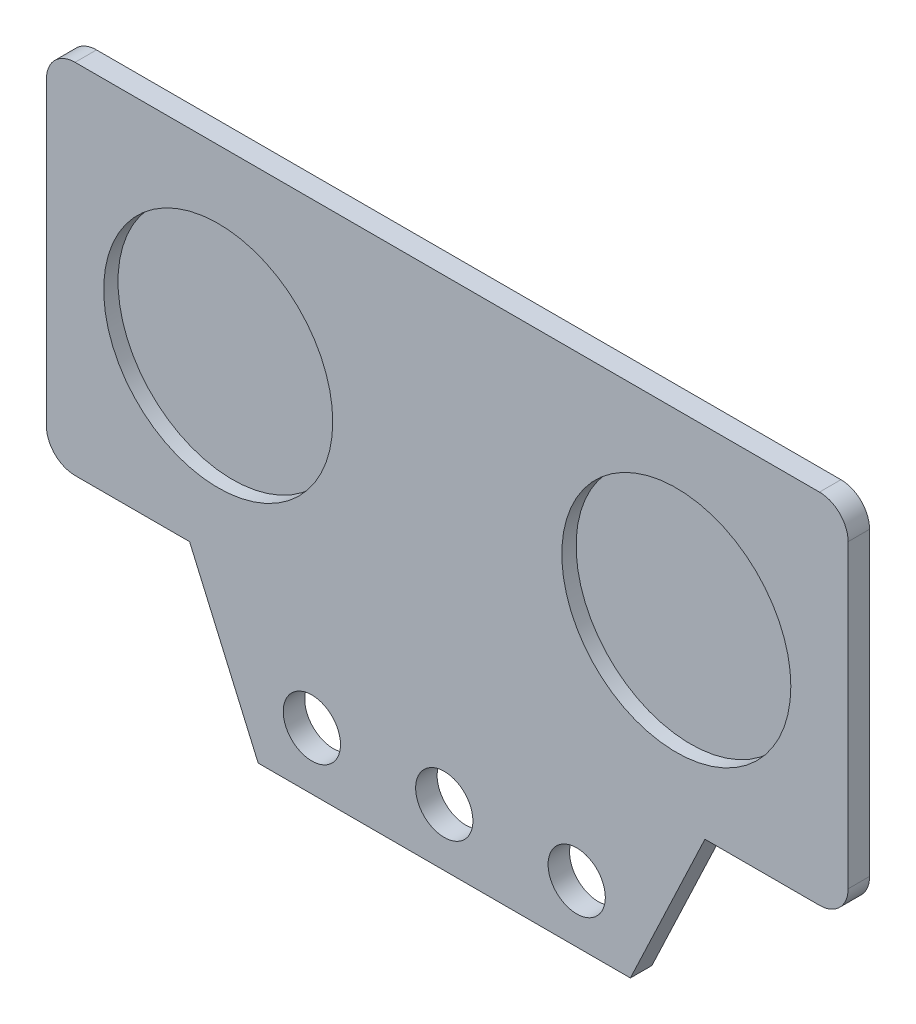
ISO-10303-21;
HEADER;
FILE_DESCRIPTION(('STEP AP214'),'2;1');
FILE_NAME('part.step','',(''),(''),'','','');
FILE_SCHEMA(('AUTOMOTIVE_DESIGN { 1 0 10303 214 1 1 1 1 }'));
ENDSEC;
DATA;
#1=APPLICATION_CONTEXT('core data for automotive mechanical design processes');
#2=APPLICATION_PROTOCOL_DEFINITION('international standard','automotive_design',2000,#1);
#3=PRODUCT_CONTEXT('',#1,'mechanical');
#4=PRODUCT('Part','Part','',(#3));
#5=PRODUCT_RELATED_PRODUCT_CATEGORY('part','',(#4));
#6=PRODUCT_DEFINITION_FORMATION('','',#4);
#7=PRODUCT_DEFINITION_CONTEXT('part definition',#1,'design');
#8=PRODUCT_DEFINITION('design','',#6,#7);
#9=PRODUCT_DEFINITION_SHAPE('','',#8);
#10=(LENGTH_UNIT() NAMED_UNIT(*) SI_UNIT(.MILLI.,.METRE.));
#11=(NAMED_UNIT(*) PLANE_ANGLE_UNIT() SI_UNIT($,.RADIAN.));
#12=(NAMED_UNIT(*) SI_UNIT($,.STERADIAN.) SOLID_ANGLE_UNIT());
#13=UNCERTAINTY_MEASURE_WITH_UNIT(LENGTH_MEASURE(1.E-05),#10,'distance_accuracy_value','');
#14=(GEOMETRIC_REPRESENTATION_CONTEXT(3) GLOBAL_UNCERTAINTY_ASSIGNED_CONTEXT((#13)) GLOBAL_UNIT_ASSIGNED_CONTEXT((#10,
#11,#12)) REPRESENTATION_CONTEXT('',''));
#15=CARTESIAN_POINT('',(0.,0.,0.));
#16=DIRECTION('',(0.,0.,1.));
#17=DIRECTION('',(1.,0.,0.));
#18=AXIS2_PLACEMENT_3D('',#15,#16,#17);
#19=CARTESIAN_POINT('',(0.,25.,0.));
#20=DIRECTION('',(-1.,0.,0.));
#21=DIRECTION('',(0.,0.,1.));
#22=AXIS2_PLACEMENT_3D('',#19,#20,#21);
#23=PLANE('',#22);
#24=DIRECTION('',(0.,-1.,0.));
#25=VECTOR('',#24,1.);
#26=CARTESIAN_POINT('',(0.,25.,0.));
#27=LINE('',#26,#25);
#28=CARTESIAN_POINT('',(0.,23.,0.));
#29=VERTEX_POINT('',#28);
#30=CARTESIAN_POINT('',(0.,2.,0.));
#31=VERTEX_POINT('',#30);
#32=EDGE_CURVE('E158',#29,#31,#27,.T.);
#33=ORIENTED_EDGE('',*,*,#32,.T.);
#34=DIRECTION('',(0.,0.,-1.));
#35=VECTOR('',#34,1.);
#36=CARTESIAN_POINT('',(0.,2.,1.5));
#37=LINE('',#36,#35);
#38=CARTESIAN_POINT('',(0.,2.,1.5));
#39=VERTEX_POINT('',#38);
#40=EDGE_CURVE('E184',#31,#39,#37,.F.);
#41=ORIENTED_EDGE('',*,*,#40,.T.);
#42=DIRECTION('',(0.,-1.,0.));
#43=VECTOR('',#42,1.);
#44=CARTESIAN_POINT('',(0.,25.,1.5));
#45=LINE('',#44,#43);
#46=CARTESIAN_POINT('',(0.,23.,1.5));
#47=VERTEX_POINT('',#46);
#48=EDGE_CURVE('E150',#47,#39,#45,.T.);
#49=ORIENTED_EDGE('',*,*,#48,.F.);
#50=DIRECTION('',(0.,0.,1.));
#51=VECTOR('',#50,1.);
#52=CARTESIAN_POINT('',(0.,23.,0.));
#53=LINE('',#52,#51);
#54=EDGE_CURVE('E182',#47,#29,#53,.F.);
#55=ORIENTED_EDGE('',*,*,#54,.T.);
#56=EDGE_LOOP('',(#33,#41,#49,#55));
#57=FACE_BOUND('',#56,.T.);
#58=ADVANCED_FACE('F33',(#57),#23,.T.);
#59=CARTESIAN_POINT('',(56.,25.,0.));
#60=DIRECTION('',(0.,1.,0.));
#61=DIRECTION('',(0.,0.,1.));
#62=AXIS2_PLACEMENT_3D('',#59,#60,#61);
#63=PLANE('',#62);
#64=DIRECTION('',(-1.,0.,0.));
#65=VECTOR('',#64,1.);
#66=CARTESIAN_POINT('',(56.,25.,0.));
#67=LINE('',#66,#65);
#68=CARTESIAN_POINT('',(54.,25.,0.));
#69=VERTEX_POINT('',#68);
#70=CARTESIAN_POINT('',(2.,25.,0.));
#71=VERTEX_POINT('',#70);
#72=EDGE_CURVE('E174',#69,#71,#67,.T.);
#73=ORIENTED_EDGE('',*,*,#72,.T.);
#74=DIRECTION('',(0.,0.,1.));
#75=VECTOR('',#74,1.);
#76=CARTESIAN_POINT('',(2.,25.,0.));
#77=LINE('',#76,#75);
#78=CARTESIAN_POINT('',(2.,25.,1.5));
#79=VERTEX_POINT('',#78);
#80=EDGE_CURVE('E194',#71,#79,#77,.T.);
#81=ORIENTED_EDGE('',*,*,#80,.T.);
#82=DIRECTION('',(-1.,0.,0.));
#83=VECTOR('',#82,1.);
#84=CARTESIAN_POINT('',(56.,25.,1.5));
#85=LINE('',#84,#83);
#86=CARTESIAN_POINT('',(54.,25.,1.5));
#87=VERTEX_POINT('',#86);
#88=EDGE_CURVE('E152',#87,#79,#85,.T.);
#89=ORIENTED_EDGE('',*,*,#88,.F.);
#90=DIRECTION('',(0.,0.,1.));
#91=VECTOR('',#90,1.);
#92=CARTESIAN_POINT('',(54.,25.,0.));
#93=LINE('',#92,#91);
#94=EDGE_CURVE('E192',#87,#69,#93,.F.);
#95=ORIENTED_EDGE('',*,*,#94,.T.);
#96=EDGE_LOOP('',(#73,#81,#89,#95));
#97=FACE_BOUND('',#96,.T.);
#98=ADVANCED_FACE('F291',(#97),#63,.T.);
#99=CARTESIAN_POINT('',(56.,-11.,0.));
#100=DIRECTION('',(1.,0.,0.));
#101=DIRECTION('',(0.,0.,-1.));
#102=AXIS2_PLACEMENT_3D('',#99,#100,#101);
#103=PLANE('',#102);
#104=DIRECTION('',(0.,1.,0.));
#105=VECTOR('',#104,1.);
#106=CARTESIAN_POINT('',(56.,-11.,1.5));
#107=LINE('',#106,#105);
#108=CARTESIAN_POINT('',(56.,2.,1.5));
#109=VERTEX_POINT('',#108);
#110=CARTESIAN_POINT('',(56.,23.,1.5));
#111=VERTEX_POINT('',#110);
#112=EDGE_CURVE('E149',#109,#111,#107,.T.);
#113=ORIENTED_EDGE('',*,*,#112,.F.);
#114=DIRECTION('',(0.,0.,-1.));
#115=VECTOR('',#114,1.);
#116=CARTESIAN_POINT('',(56.,2.,0.));
#117=LINE('',#116,#115);
#118=CARTESIAN_POINT('',(56.,2.,0.));
#119=VERTEX_POINT('',#118);
#120=EDGE_CURVE('E41',#109,#119,#117,.T.);
#121=ORIENTED_EDGE('',*,*,#120,.T.);
#122=DIRECTION('',(0.,1.,0.));
#123=VECTOR('',#122,1.);
#124=CARTESIAN_POINT('',(56.,-11.,0.));
#125=LINE('',#124,#123);
#126=CARTESIAN_POINT('',(56.,23.,0.));
#127=VERTEX_POINT('',#126);
#128=EDGE_CURVE('E205',#119,#127,#125,.T.);
#129=ORIENTED_EDGE('',*,*,#128,.T.);
#130=DIRECTION('',(0.,0.,1.));
#131=VECTOR('',#130,1.);
#132=CARTESIAN_POINT('',(56.,23.,0.));
#133=LINE('',#132,#131);
#134=EDGE_CURVE('E196',#127,#111,#133,.T.);
#135=ORIENTED_EDGE('',*,*,#134,.T.);
#136=EDGE_LOOP('',(#113,#121,#129,#135));
#137=FACE_BOUND('',#136,.T.);
#138=ADVANCED_FACE('F204',(#137),#103,.T.);
#139=CARTESIAN_POINT('',(0.,-11.,0.));
#140=DIRECTION('',(0.,-1.,0.));
#141=DIRECTION('',(1.,0.,0.));
#142=AXIS2_PLACEMENT_3D('',#139,#140,#141);
#143=PLANE('',#142);
#144=DIRECTION('',(0.,0.,-1.));
#145=VECTOR('',#144,1.);
#146=CARTESIAN_POINT('',(14.7916291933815,-11.,1.5));
#147=LINE('',#146,#145);
#148=CARTESIAN_POINT('',(14.7916291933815,-11.,1.5));
#149=VERTEX_POINT('',#148);
#150=CARTESIAN_POINT('',(14.7916291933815,-11.,0.));
#151=VERTEX_POINT('',#150);
#152=EDGE_CURVE('E123',#149,#151,#147,.T.);
#153=ORIENTED_EDGE('',*,*,#152,.T.);
#154=DIRECTION('',(1.,0.,0.));
#155=VECTOR('',#154,1.);
#156=CARTESIAN_POINT('',(0.,-11.,0.));
#157=LINE('',#156,#155);
#158=CARTESIAN_POINT('',(40.7916291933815,-11.,0.));
#159=VERTEX_POINT('',#158);
#160=EDGE_CURVE('E216',#151,#159,#157,.T.);
#161=ORIENTED_EDGE('',*,*,#160,.T.);
#162=DIRECTION('',(0.,0.,-1.));
#163=VECTOR('',#162,1.);
#164=CARTESIAN_POINT('',(40.7916291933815,-11.,1.5));
#165=LINE('',#164,#163);
#166=CARTESIAN_POINT('',(40.7916291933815,-11.,1.5));
#167=VERTEX_POINT('',#166);
#168=EDGE_CURVE('E148',#167,#159,#165,.T.);
#169=ORIENTED_EDGE('',*,*,#168,.F.);
#170=DIRECTION('',(1.,0.,0.));
#171=VECTOR('',#170,1.);
#172=CARTESIAN_POINT('',(0.,-11.,1.5));
#173=LINE('',#172,#171);
#174=EDGE_CURVE('E140',#149,#167,#173,.T.);
#175=ORIENTED_EDGE('',*,*,#174,.F.);
#176=EDGE_LOOP('',(#153,#161,#169,#175));
#177=FACE_BOUND('',#176,.T.);
#178=ADVANCED_FACE('F146',(#177),#143,.T.);
#179=CARTESIAN_POINT('',(0.,0.,0.));
#180=DIRECTION('',(0.,0.,1.));
#181=DIRECTION('',(1.,0.,0.));
#182=AXIS2_PLACEMENT_3D('',#179,#180,#181);
#183=PLANE('',#182);
#184=CARTESIAN_POINT('',(37.0416291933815,-6.99999999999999,0.));
#185=DIRECTION('',(0.,0.,1.));
#186=DIRECTION('',(1.,0.,0.));
#187=AXIS2_PLACEMENT_3D('',#184,#185,#186);
#188=CIRCLE('',#187,1.99999999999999);
#189=CARTESIAN_POINT('',(39.0416291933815,-6.99999999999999,0.));
#190=VERTEX_POINT('',#189);
#191=EDGE_CURVE('E241',#190,#190,#188,.T.);
#192=ORIENTED_EDGE('',*,*,#191,.T.);
#193=EDGE_LOOP('',(#192));
#194=FACE_BOUND('',#193,.T.);
#195=CARTESIAN_POINT('',(18.5416291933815,-6.99999999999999,0.));
#196=DIRECTION('',(0.,0.,1.));
#197=DIRECTION('',(1.,0.,0.));
#198=AXIS2_PLACEMENT_3D('',#195,#196,#197);
#199=CIRCLE('',#198,1.99999999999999);
#200=CARTESIAN_POINT('',(20.5416291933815,-6.99999999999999,0.));
#201=VERTEX_POINT('',#200);
#202=EDGE_CURVE('E235',#201,#201,#199,.T.);
#203=ORIENTED_EDGE('',*,*,#202,.T.);
#204=EDGE_LOOP('',(#203));
#205=FACE_BOUND('',#204,.T.);
#206=CARTESIAN_POINT('',(27.7916291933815,-6.99999999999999,0.));
#207=DIRECTION('',(0.,0.,1.));
#208=DIRECTION('',(1.,0.,0.));
#209=AXIS2_PLACEMENT_3D('',#206,#207,#208);
#210=CIRCLE('',#209,1.99999999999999);
#211=CARTESIAN_POINT('',(29.7916291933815,-6.99999999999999,0.));
#212=VERTEX_POINT('',#211);
#213=EDGE_CURVE('E228',#212,#212,#210,.T.);
#214=ORIENTED_EDGE('',*,*,#213,.T.);
#215=EDGE_LOOP('',(#214));
#216=FACE_BOUND('',#215,.T.);
#217=DIRECTION('',(1.,0.,0.));
#218=VECTOR('',#217,1.);
#219=CARTESIAN_POINT('',(0.,0.,0.));
#220=LINE('',#219,#218);
#221=CARTESIAN_POINT('',(2.,0.,0.));
#222=VERTEX_POINT('',#221);
#223=CARTESIAN_POINT('',(9.99999999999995,0.,0.));
#224=VERTEX_POINT('',#223);
#225=EDGE_CURVE('E160',#222,#224,#220,.T.);
#226=ORIENTED_EDGE('',*,*,#225,.F.);
#227=CARTESIAN_POINT('',(2.,2.,0.));
#228=DIRECTION('',(0.,0.,1.));
#229=DIRECTION('',(1.,0.,0.));
#230=AXIS2_PLACEMENT_3D('',#227,#228,#229);
#231=CIRCLE('',#230,2.);
#232=EDGE_CURVE('E180',#222,#31,#231,.F.);
#233=ORIENTED_EDGE('',*,*,#232,.T.);
#234=ORIENTED_EDGE('',*,*,#32,.F.);
#235=CARTESIAN_POINT('',(2.,23.,0.));
#236=DIRECTION('',(0.,0.,1.));
#237=DIRECTION('',(1.,0.,0.));
#238=AXIS2_PLACEMENT_3D('',#235,#236,#237);
#239=CIRCLE('',#238,2.);
#240=EDGE_CURVE('E178',#29,#71,#239,.F.);
#241=ORIENTED_EDGE('',*,*,#240,.T.);
#242=ORIENTED_EDGE('',*,*,#72,.F.);
#243=CARTESIAN_POINT('',(54.,23.,0.));
#244=DIRECTION('',(0.,0.,1.));
#245=DIRECTION('',(1.,0.,0.));
#246=AXIS2_PLACEMENT_3D('',#243,#244,#245);
#247=CIRCLE('',#246,2.);
#248=EDGE_CURVE('E173',#69,#127,#247,.F.);
#249=ORIENTED_EDGE('',*,*,#248,.T.);
#250=ORIENTED_EDGE('',*,*,#128,.F.);
#251=CARTESIAN_POINT('',(54.,2.,0.));
#252=DIRECTION('',(0.,0.,1.));
#253=DIRECTION('',(1.,0.,0.));
#254=AXIS2_PLACEMENT_3D('',#251,#252,#253);
#255=CIRCLE('',#254,2.);
#256=CARTESIAN_POINT('',(54.,0.,0.));
#257=VERTEX_POINT('',#256);
#258=EDGE_CURVE('E176',#119,#257,#255,.F.);
#259=ORIENTED_EDGE('',*,*,#258,.T.);
#260=DIRECTION('',(1.,0.,0.));
#261=VECTOR('',#260,1.);
#262=CARTESIAN_POINT('',(40.7916291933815,0.,0.));
#263=LINE('',#262,#261);
#264=CARTESIAN_POINT('',(46.,0.,0.));
#265=VERTEX_POINT('',#264);
#266=EDGE_CURVE('E164',#265,#257,#263,.T.);
#267=ORIENTED_EDGE('',*,*,#266,.F.);
#268=DIRECTION('',(-0.427941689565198,-0.903806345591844,0.));
#269=VECTOR('',#268,1.);
#270=CARTESIAN_POINT('',(40.7916291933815,-11.,0.));
#271=LINE('',#270,#269);
#272=EDGE_CURVE('E134',#159,#265,#271,.F.);
#273=ORIENTED_EDGE('',*,*,#272,.F.);
#274=ORIENTED_EDGE('',*,*,#160,.F.);
#275=DIRECTION('',(-0.399358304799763,0.916794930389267,0.));
#276=VECTOR('',#275,1.);
#277=CARTESIAN_POINT('',(14.7916291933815,-11.,0.));
#278=LINE('',#277,#276);
#279=EDGE_CURVE('E130',#224,#151,#278,.F.);
#280=ORIENTED_EDGE('',*,*,#279,.F.);
#281=EDGE_LOOP('',(#226,#233,#234,#241,#242,#249,#250,#259,#267,#273,#274,#280));
#282=FACE_BOUND('',#281,.T.);
#283=ADVANCED_FACE('F211',(#194,#205,#216,#282),#183,.F.);
#284=CARTESIAN_POINT('',(0.,0.,1.5));
#285=DIRECTION('',(0.,0.,1.));
#286=DIRECTION('',(1.,0.,0.));
#287=AXIS2_PLACEMENT_3D('',#284,#285,#286);
#288=PLANE('',#287);
#289=CARTESIAN_POINT('',(44.,12.2509013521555,1.5));
#290=DIRECTION('',(0.,0.,1.));
#291=DIRECTION('',(1.,0.,0.));
#292=AXIS2_PLACEMENT_3D('',#289,#290,#291);
#293=CIRCLE('',#292,7.99999999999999);
#294=CARTESIAN_POINT('',(52.,12.2509013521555,1.5));
#295=VERTEX_POINT('',#294);
#296=EDGE_CURVE('E256',#295,#295,#293,.T.);
#297=ORIENTED_EDGE('',*,*,#296,.F.);
#298=EDGE_LOOP('',(#297));
#299=FACE_BOUND('',#298,.T.);
#300=CARTESIAN_POINT('',(12.,12.2509013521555,1.5));
#301=DIRECTION('',(0.,0.,1.));
#302=DIRECTION('',(1.,0.,0.));
#303=AXIS2_PLACEMENT_3D('',#300,#301,#302);
#304=CIRCLE('',#303,7.99999999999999);
#305=CARTESIAN_POINT('',(20.,12.2509013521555,1.5));
#306=VERTEX_POINT('',#305);
#307=EDGE_CURVE('E250',#306,#306,#304,.T.);
#308=ORIENTED_EDGE('',*,*,#307,.F.);
#309=EDGE_LOOP('',(#308));
#310=FACE_BOUND('',#309,.T.);
#311=CARTESIAN_POINT('',(37.0416291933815,-6.99999999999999,1.5));
#312=DIRECTION('',(0.,0.,1.));
#313=DIRECTION('',(1.,0.,0.));
#314=AXIS2_PLACEMENT_3D('',#311,#312,#313);
#315=CIRCLE('',#314,1.99999999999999);
#316=CARTESIAN_POINT('',(39.0416291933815,-6.99999999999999,1.5));
#317=VERTEX_POINT('',#316);
#318=EDGE_CURVE('E244',#317,#317,#315,.T.);
#319=ORIENTED_EDGE('',*,*,#318,.F.);
#320=EDGE_LOOP('',(#319));
#321=FACE_BOUND('',#320,.T.);
#322=CARTESIAN_POINT('',(18.5416291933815,-6.99999999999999,1.5));
#323=DIRECTION('',(0.,0.,1.));
#324=DIRECTION('',(1.,0.,0.));
#325=AXIS2_PLACEMENT_3D('',#322,#323,#324);
#326=CIRCLE('',#325,2.);
#327=CARTESIAN_POINT('',(20.5416291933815,-6.99999999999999,1.5));
#328=VERTEX_POINT('',#327);
#329=EDGE_CURVE('E238',#328,#328,#326,.T.);
#330=ORIENTED_EDGE('',*,*,#329,.F.);
#331=EDGE_LOOP('',(#330));
#332=FACE_BOUND('',#331,.T.);
#333=CARTESIAN_POINT('',(27.7916291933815,-6.99999999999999,1.5));
#334=DIRECTION('',(0.,0.,1.));
#335=DIRECTION('',(1.,0.,0.));
#336=AXIS2_PLACEMENT_3D('',#333,#334,#335);
#337=CIRCLE('',#336,1.99999999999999);
#338=CARTESIAN_POINT('',(29.7916291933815,-6.99999999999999,1.5));
#339=VERTEX_POINT('',#338);
#340=EDGE_CURVE('E232',#339,#339,#337,.T.);
#341=ORIENTED_EDGE('',*,*,#340,.F.);
#342=EDGE_LOOP('',(#341));
#343=FACE_BOUND('',#342,.T.);
#344=ORIENTED_EDGE('',*,*,#48,.T.);
#345=CARTESIAN_POINT('',(2.,2.,1.5));
#346=DIRECTION('',(0.,0.,1.));
#347=DIRECTION('',(1.,0.,0.));
#348=AXIS2_PLACEMENT_3D('',#345,#346,#347);
#349=CIRCLE('',#348,2.);
#350=CARTESIAN_POINT('',(2.,0.,1.5));
#351=VERTEX_POINT('',#350);
#352=EDGE_CURVE('E190',#39,#351,#349,.T.);
#353=ORIENTED_EDGE('',*,*,#352,.T.);
#354=DIRECTION('',(1.,0.,0.));
#355=VECTOR('',#354,1.);
#356=CARTESIAN_POINT('',(0.,0.,1.5));
#357=LINE('',#356,#355);
#358=CARTESIAN_POINT('',(9.99999999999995,0.,1.5));
#359=VERTEX_POINT('',#358);
#360=EDGE_CURVE('E143',#351,#359,#357,.T.);
#361=ORIENTED_EDGE('',*,*,#360,.T.);
#362=DIRECTION('',(-0.399358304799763,0.916794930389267,0.));
#363=VECTOR('',#362,1.);
#364=CARTESIAN_POINT('',(14.7916291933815,-11.,1.5));
#365=LINE('',#364,#363);
#366=EDGE_CURVE('E127',#359,#149,#365,.F.);
#367=ORIENTED_EDGE('',*,*,#366,.T.);
#368=ORIENTED_EDGE('',*,*,#174,.T.);
#369=DIRECTION('',(-0.427941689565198,-0.903806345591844,0.));
#370=VECTOR('',#369,1.);
#371=CARTESIAN_POINT('',(40.7916291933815,-11.,1.5));
#372=LINE('',#371,#370);
#373=CARTESIAN_POINT('',(46.,0.,1.5));
#374=VERTEX_POINT('',#373);
#375=EDGE_CURVE('E165',#167,#374,#372,.F.);
#376=ORIENTED_EDGE('',*,*,#375,.T.);
#377=DIRECTION('',(1.,0.,0.));
#378=VECTOR('',#377,1.);
#379=CARTESIAN_POINT('',(40.7916291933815,0.,1.5));
#380=LINE('',#379,#378);
#381=CARTESIAN_POINT('',(54.,0.,1.5));
#382=VERTEX_POINT('',#381);
#383=EDGE_CURVE('E167',#374,#382,#380,.T.);
#384=ORIENTED_EDGE('',*,*,#383,.T.);
#385=CARTESIAN_POINT('',(54.,2.,1.5));
#386=DIRECTION('',(0.,0.,1.));
#387=DIRECTION('',(1.,0.,0.));
#388=AXIS2_PLACEMENT_3D('',#385,#386,#387);
#389=CIRCLE('',#388,2.);
#390=EDGE_CURVE('E187',#382,#109,#389,.T.);
#391=ORIENTED_EDGE('',*,*,#390,.T.);
#392=ORIENTED_EDGE('',*,*,#112,.T.);
#393=CARTESIAN_POINT('',(54.,23.,1.5));
#394=DIRECTION('',(0.,0.,1.));
#395=DIRECTION('',(1.,0.,0.));
#396=AXIS2_PLACEMENT_3D('',#393,#394,#395);
#397=CIRCLE('',#396,2.);
#398=EDGE_CURVE('E56',#111,#87,#397,.T.);
#399=ORIENTED_EDGE('',*,*,#398,.T.);
#400=ORIENTED_EDGE('',*,*,#88,.T.);
#401=CARTESIAN_POINT('',(2.,23.,1.5));
#402=DIRECTION('',(0.,0.,1.));
#403=DIRECTION('',(1.,0.,0.));
#404=AXIS2_PLACEMENT_3D('',#401,#402,#403);
#405=CIRCLE('',#404,2.);
#406=EDGE_CURVE('E48',#79,#47,#405,.T.);
#407=ORIENTED_EDGE('',*,*,#406,.T.);
#408=EDGE_LOOP('',(#344,#353,#361,#367,#368,#376,#384,#391,#392,#399,#400,#407));
#409=FACE_BOUND('',#408,.T.);
#410=ADVANCED_FACE('F138',(#299,#310,#321,#332,#343,#409),#288,.T.);
#411=CARTESIAN_POINT('',(40.7916291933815,-11.,1.5));
#412=DIRECTION('',(0.903806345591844,-0.427941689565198,0.));
#413=DIRECTION('',(0.427941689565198,0.903806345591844,0.));
#414=AXIS2_PLACEMENT_3D('',#411,#412,#413);
#415=PLANE('',#414);
#416=ORIENTED_EDGE('',*,*,#272,.T.);
#417=DIRECTION('',(0.,0.,1.));
#418=VECTOR('',#417,1.);
#419=CARTESIAN_POINT('',(46.,0.,1.5));
#420=LINE('',#419,#418);
#421=EDGE_CURVE('E168',#374,#265,#420,.F.);
#422=ORIENTED_EDGE('',*,*,#421,.F.);
#423=ORIENTED_EDGE('',*,*,#375,.F.);
#424=ORIENTED_EDGE('',*,*,#168,.T.);
#425=EDGE_LOOP('',(#416,#422,#423,#424));
#426=FACE_BOUND('',#425,.T.);
#427=ADVANCED_FACE('F264',(#426),#415,.T.);
#428=CARTESIAN_POINT('',(40.7916291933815,0.,1.5));
#429=DIRECTION('',(0.,1.,0.));
#430=DIRECTION('',(0.,0.,1.));
#431=AXIS2_PLACEMENT_3D('',#428,#429,#430);
#432=PLANE('',#431);
#433=ORIENTED_EDGE('',*,*,#266,.T.);
#434=DIRECTION('',(0.,0.,-1.));
#435=VECTOR('',#434,1.);
#436=CARTESIAN_POINT('',(54.,0.,1.5));
#437=LINE('',#436,#435);
#438=EDGE_CURVE('E11',#257,#382,#437,.F.);
#439=ORIENTED_EDGE('',*,*,#438,.T.);
#440=ORIENTED_EDGE('',*,*,#383,.F.);
#441=ORIENTED_EDGE('',*,*,#421,.T.);
#442=EDGE_LOOP('',(#433,#439,#440,#441));
#443=FACE_BOUND('',#442,.T.);
#444=ADVANCED_FACE('F304',(#443),#432,.F.);
#445=CARTESIAN_POINT('',(14.7916291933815,-11.,1.5));
#446=DIRECTION('',(-0.916794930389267,-0.399358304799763,0.));
#447=DIRECTION('',(0.399358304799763,-0.916794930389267,0.));
#448=AXIS2_PLACEMENT_3D('',#445,#446,#447);
#449=PLANE('',#448);
#450=ORIENTED_EDGE('',*,*,#279,.T.);
#451=ORIENTED_EDGE('',*,*,#152,.F.);
#452=ORIENTED_EDGE('',*,*,#366,.F.);
#453=DIRECTION('',(0.,0.,1.));
#454=VECTOR('',#453,1.);
#455=CARTESIAN_POINT('',(9.99999999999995,0.,1.5));
#456=LINE('',#455,#454);
#457=EDGE_CURVE('E135',#359,#224,#456,.F.);
#458=ORIENTED_EDGE('',*,*,#457,.T.);
#459=EDGE_LOOP('',(#450,#451,#452,#458));
#460=FACE_BOUND('',#459,.T.);
#461=ADVANCED_FACE('F125',(#460),#449,.T.);
#462=CARTESIAN_POINT('',(0.,0.,1.5));
#463=DIRECTION('',(0.,1.,0.));
#464=DIRECTION('',(-1.,0.,0.));
#465=AXIS2_PLACEMENT_3D('',#462,#463,#464);
#466=PLANE('',#465);
#467=ORIENTED_EDGE('',*,*,#360,.F.);
#468=DIRECTION('',(0.,0.,-1.));
#469=VECTOR('',#468,1.);
#470=CARTESIAN_POINT('',(2.,0.,0.));
#471=LINE('',#470,#469);
#472=EDGE_CURVE('E170',#351,#222,#471,.T.);
#473=ORIENTED_EDGE('',*,*,#472,.T.);
#474=ORIENTED_EDGE('',*,*,#225,.T.);
#475=ORIENTED_EDGE('',*,*,#457,.F.);
#476=EDGE_LOOP('',(#467,#473,#474,#475));
#477=FACE_BOUND('',#476,.T.);
#478=ADVANCED_FACE('F277',(#477),#466,.F.);
#479=CARTESIAN_POINT('',(27.7916291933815,-6.99999999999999,1.5));
#480=DIRECTION('',(0.,0.,1.));
#481=DIRECTION('',(1.,0.,0.));
#482=AXIS2_PLACEMENT_3D('',#479,#480,#481);
#483=CYLINDRICAL_SURFACE('',#482,1.99999999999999);
#484=ORIENTED_EDGE('',*,*,#213,.F.);
#485=EDGE_LOOP('',(#484));
#486=FACE_BOUND('',#485,.T.);
#487=ORIENTED_EDGE('',*,*,#340,.T.);
#488=EDGE_LOOP('',(#487));
#489=FACE_BOUND('',#488,.T.);
#490=ADVANCED_FACE('F274',(#486,#489),#483,.F.);
#491=CARTESIAN_POINT('',(18.5416291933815,-6.99999999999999,1.5));
#492=DIRECTION('',(0.,0.,1.));
#493=DIRECTION('',(1.,0.,0.));
#494=AXIS2_PLACEMENT_3D('',#491,#492,#493);
#495=CYLINDRICAL_SURFACE('',#494,2.);
#496=ORIENTED_EDGE('',*,*,#202,.F.);
#497=EDGE_LOOP('',(#496));
#498=FACE_BOUND('',#497,.T.);
#499=ORIENTED_EDGE('',*,*,#329,.T.);
#500=EDGE_LOOP('',(#499));
#501=FACE_BOUND('',#500,.T.);
#502=ADVANCED_FACE('F276',(#498,#501),#495,.F.);
#503=CARTESIAN_POINT('',(37.0416291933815,-6.99999999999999,1.5));
#504=DIRECTION('',(0.,0.,1.));
#505=DIRECTION('',(1.,0.,0.));
#506=AXIS2_PLACEMENT_3D('',#503,#504,#505);
#507=CYLINDRICAL_SURFACE('',#506,1.99999999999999);
#508=ORIENTED_EDGE('',*,*,#191,.F.);
#509=EDGE_LOOP('',(#508));
#510=FACE_BOUND('',#509,.T.);
#511=ORIENTED_EDGE('',*,*,#318,.T.);
#512=EDGE_LOOP('',(#511));
#513=FACE_BOUND('',#512,.T.);
#514=ADVANCED_FACE('F284',(#510,#513),#507,.F.);
#515=CARTESIAN_POINT('',(12.,12.2509013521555,0.500000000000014));
#516=DIRECTION('',(0.,0.,-1.));
#517=DIRECTION('',(-1.,0.,0.));
#518=AXIS2_PLACEMENT_3D('',#515,#516,#517);
#519=PLANE('',#518);
#520=CARTESIAN_POINT('',(12.,12.2509013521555,0.499999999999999));
#521=DIRECTION('',(0.,0.,1.));
#522=DIRECTION('',(1.,0.,0.));
#523=AXIS2_PLACEMENT_3D('',#520,#521,#522);
#524=CIRCLE('',#523,7.99999999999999);
#525=CARTESIAN_POINT('',(20.,12.2509013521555,0.499999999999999));
#526=VERTEX_POINT('',#525);
#527=EDGE_CURVE('E247',#526,#526,#524,.T.);
#528=ORIENTED_EDGE('',*,*,#527,.T.);
#529=EDGE_LOOP('',(#528));
#530=FACE_BOUND('',#529,.T.);
#531=ADVANCED_FACE('F380',(#530),#519,.F.);
#532=CARTESIAN_POINT('',(12.,12.2509013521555,1.5));
#533=DIRECTION('',(0.,0.,1.));
#534=DIRECTION('',(1.,0.,0.));
#535=AXIS2_PLACEMENT_3D('',#532,#533,#534);
#536=CYLINDRICAL_SURFACE('',#535,7.99999999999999);
#537=ORIENTED_EDGE('',*,*,#527,.F.);
#538=EDGE_LOOP('',(#537));
#539=FACE_BOUND('',#538,.T.);
#540=ORIENTED_EDGE('',*,*,#307,.T.);
#541=EDGE_LOOP('',(#540));
#542=FACE_BOUND('',#541,.T.);
#543=ADVANCED_FACE('F390',(#539,#542),#536,.F.);
#544=CARTESIAN_POINT('',(44.,12.2509013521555,0.500000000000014));
#545=DIRECTION('',(0.,0.,-1.));
#546=DIRECTION('',(-1.,0.,0.));
#547=AXIS2_PLACEMENT_3D('',#544,#545,#546);
#548=PLANE('',#547);
#549=CARTESIAN_POINT('',(44.,12.2509013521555,0.499999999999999));
#550=DIRECTION('',(0.,0.,1.));
#551=DIRECTION('',(1.,0.,0.));
#552=AXIS2_PLACEMENT_3D('',#549,#550,#551);
#553=CIRCLE('',#552,7.99999999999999);
#554=CARTESIAN_POINT('',(52.,12.2509013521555,0.499999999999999));
#555=VERTEX_POINT('',#554);
#556=EDGE_CURVE('E253',#555,#555,#553,.T.);
#557=ORIENTED_EDGE('',*,*,#556,.T.);
#558=EDGE_LOOP('',(#557));
#559=FACE_BOUND('',#558,.T.);
#560=ADVANCED_FACE('F400',(#559),#548,.F.);
#561=CARTESIAN_POINT('',(44.,12.2509013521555,1.5));
#562=DIRECTION('',(0.,0.,1.));
#563=DIRECTION('',(1.,0.,0.));
#564=AXIS2_PLACEMENT_3D('',#561,#562,#563);
#565=CYLINDRICAL_SURFACE('',#564,7.99999999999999);
#566=ORIENTED_EDGE('',*,*,#556,.F.);
#567=EDGE_LOOP('',(#566));
#568=FACE_BOUND('',#567,.T.);
#569=ORIENTED_EDGE('',*,*,#296,.T.);
#570=EDGE_LOOP('',(#569));
#571=FACE_BOUND('',#570,.T.);
#572=ADVANCED_FACE('F260',(#568,#571),#565,.F.);
#573=CARTESIAN_POINT('',(2.,2.,1.5));
#574=DIRECTION('',(0.,0.,1.));
#575=DIRECTION('',(1.,0.,0.));
#576=AXIS2_PLACEMENT_3D('',#573,#574,#575);
#577=CYLINDRICAL_SURFACE('',#576,2.);
#578=ORIENTED_EDGE('',*,*,#352,.F.);
#579=ORIENTED_EDGE('',*,*,#40,.F.);
#580=ORIENTED_EDGE('',*,*,#232,.F.);
#581=ORIENTED_EDGE('',*,*,#472,.F.);
#582=EDGE_LOOP('',(#578,#579,#580,#581));
#583=FACE_BOUND('',#582,.T.);
#584=ADVANCED_FACE('F308',(#583),#577,.T.);
#585=CARTESIAN_POINT('',(2.,23.,0.));
#586=DIRECTION('',(0.,0.,1.));
#587=DIRECTION('',(1.,0.,0.));
#588=AXIS2_PLACEMENT_3D('',#585,#586,#587);
#589=CYLINDRICAL_SURFACE('',#588,2.);
#590=ORIENTED_EDGE('',*,*,#240,.F.);
#591=ORIENTED_EDGE('',*,*,#54,.F.);
#592=ORIENTED_EDGE('',*,*,#406,.F.);
#593=ORIENTED_EDGE('',*,*,#80,.F.);
#594=EDGE_LOOP('',(#590,#591,#592,#593));
#595=FACE_BOUND('',#594,.T.);
#596=ADVANCED_FACE('F311',(#595),#589,.T.);
#597=CARTESIAN_POINT('',(54.,2.,0.));
#598=DIRECTION('',(0.,0.,1.));
#599=DIRECTION('',(1.,0.,0.));
#600=AXIS2_PLACEMENT_3D('',#597,#598,#599);
#601=CYLINDRICAL_SURFACE('',#600,2.);
#602=ORIENTED_EDGE('',*,*,#390,.F.);
#603=ORIENTED_EDGE('',*,*,#438,.F.);
#604=ORIENTED_EDGE('',*,*,#258,.F.);
#605=ORIENTED_EDGE('',*,*,#120,.F.);
#606=EDGE_LOOP('',(#602,#603,#604,#605));
#607=FACE_BOUND('',#606,.T.);
#608=ADVANCED_FACE('F314',(#607),#601,.T.);
#609=CARTESIAN_POINT('',(54.,23.,0.));
#610=DIRECTION('',(0.,0.,1.));
#611=DIRECTION('',(1.,0.,0.));
#612=AXIS2_PLACEMENT_3D('',#609,#610,#611);
#613=CYLINDRICAL_SURFACE('',#612,2.);
#614=ORIENTED_EDGE('',*,*,#248,.F.);
#615=ORIENTED_EDGE('',*,*,#94,.F.);
#616=ORIENTED_EDGE('',*,*,#398,.F.);
#617=ORIENTED_EDGE('',*,*,#134,.F.);
#618=EDGE_LOOP('',(#614,#615,#616,#617));
#619=FACE_BOUND('',#618,.T.);
#620=ADVANCED_FACE('F35',(#619),#613,.T.);
#621=CLOSED_SHELL('',(#58,#98,#138,#178,#283,#410,#427,#444,#461,#478,#490,#502,#514,#531,#543,
#560,#572,#584,#596,#608,#620));
#622=MANIFOLD_SOLID_BREP('B2',#621);
#623=ADVANCED_BREP_SHAPE_REPRESENTATION('',(#18,#622),#14);
#624=SHAPE_DEFINITION_REPRESENTATION(#9,#623);
ENDSEC;
END-ISO-10303-21;
